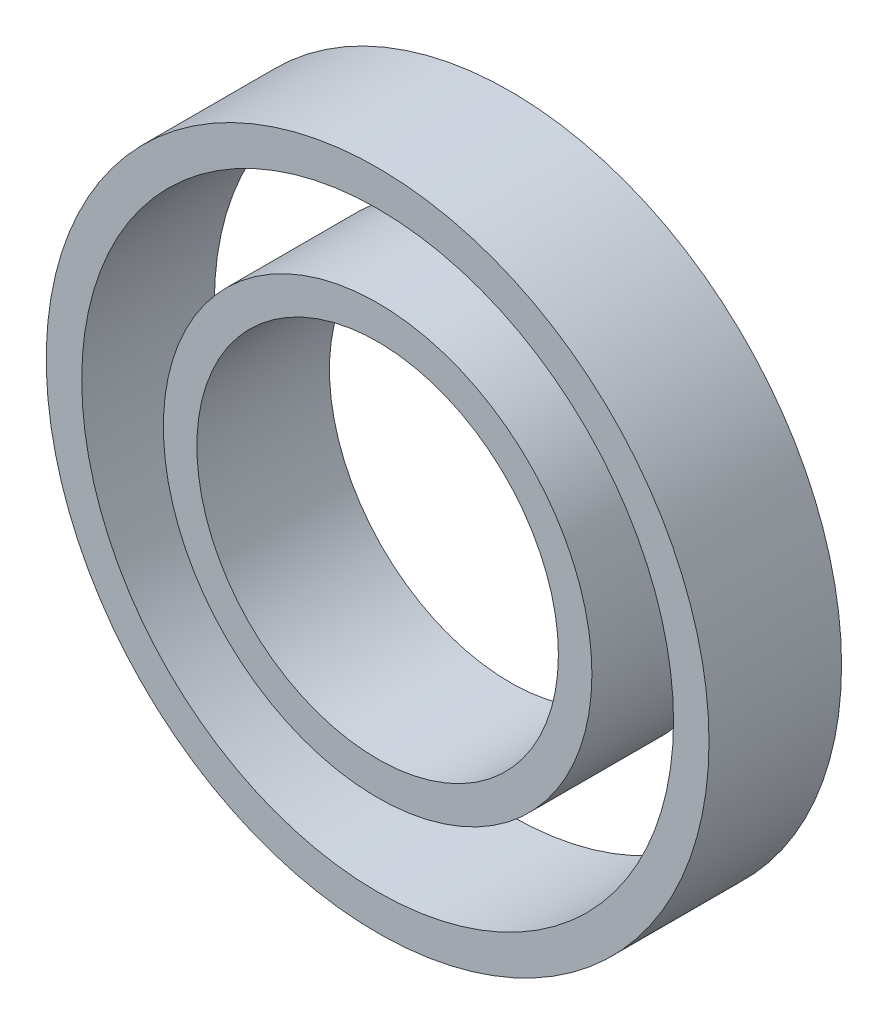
ISO-10303-21;
HEADER;
FILE_DESCRIPTION(('STEP AP214'),'2;1');
FILE_NAME('part.step','',(''),(''),'','','');
FILE_SCHEMA(('AUTOMOTIVE_DESIGN { 1 0 10303 214 1 1 1 1 }'));
ENDSEC;
DATA;
#1=APPLICATION_CONTEXT('core data for automotive mechanical design processes');
#2=APPLICATION_PROTOCOL_DEFINITION('international standard','automotive_design',2000,#1);
#3=PRODUCT_CONTEXT('',#1,'mechanical');
#4=PRODUCT('Part','Part','',(#3));
#5=PRODUCT_RELATED_PRODUCT_CATEGORY('part','',(#4));
#6=PRODUCT_DEFINITION_FORMATION('','',#4);
#7=PRODUCT_DEFINITION_CONTEXT('part definition',#1,'design');
#8=PRODUCT_DEFINITION('design','',#6,#7);
#9=PRODUCT_DEFINITION_SHAPE('','',#8);
#10=(LENGTH_UNIT() NAMED_UNIT(*) SI_UNIT(.MILLI.,.METRE.));
#11=(NAMED_UNIT(*) PLANE_ANGLE_UNIT() SI_UNIT($,.RADIAN.));
#12=(NAMED_UNIT(*) SI_UNIT($,.STERADIAN.) SOLID_ANGLE_UNIT());
#13=UNCERTAINTY_MEASURE_WITH_UNIT(LENGTH_MEASURE(1.E-05),#10,'distance_accuracy_value','');
#14=(GEOMETRIC_REPRESENTATION_CONTEXT(3) GLOBAL_UNCERTAINTY_ASSIGNED_CONTEXT((#13)) GLOBAL_UNIT_ASSIGNED_CONTEXT((#10,
#11,#12)) REPRESENTATION_CONTEXT('',''));
#15=CARTESIAN_POINT('',(0.,0.,0.));
#16=DIRECTION('',(0.,0.,1.));
#17=DIRECTION('',(1.,0.,0.));
#18=AXIS2_PLACEMENT_3D('',#15,#16,#17);
#19=CARTESIAN_POINT('',(0.,0.,10.9982));
#20=DIRECTION('',(0.,0.,-1.));
#21=DIRECTION('',(-1.,0.,0.));
#22=AXIS2_PLACEMENT_3D('',#19,#20,#21);
#23=CYLINDRICAL_SURFACE('',#22,29.9974);
#24=CARTESIAN_POINT('',(0.,0.,10.9982));
#25=DIRECTION('',(0.,0.,1.));
#26=DIRECTION('',(1.,0.,0.));
#27=AXIS2_PLACEMENT_3D('',#24,#25,#26);
#28=CIRCLE('',#27,29.9974);
#29=CARTESIAN_POINT('',(29.9974,0.,10.9982));
#30=VERTEX_POINT('',#29);
#31=EDGE_CURVE('E56',#30,#30,#28,.T.);
#32=ORIENTED_EDGE('',*,*,#31,.T.);
#33=EDGE_LOOP('',(#32));
#34=FACE_BOUND('',#33,.T.);
#35=CARTESIAN_POINT('',(0.,0.,-10.9982));
#36=DIRECTION('',(0.,0.,1.));
#37=DIRECTION('',(1.,0.,0.));
#38=AXIS2_PLACEMENT_3D('',#35,#36,#37);
#39=CIRCLE('',#38,29.9974);
#40=CARTESIAN_POINT('',(29.9974,0.,-10.9982));
#41=VERTEX_POINT('',#40);
#42=EDGE_CURVE('E64',#41,#41,#39,.T.);
#43=ORIENTED_EDGE('',*,*,#42,.F.);
#44=EDGE_LOOP('',(#43));
#45=FACE_BOUND('',#44,.T.);
#46=ADVANCED_FACE('F50',(#34,#45),#23,.F.);
#47=CARTESIAN_POINT('',(0.,0.,10.9982));
#48=DIRECTION('',(0.,0.,-1.));
#49=DIRECTION('',(-1.,0.,0.));
#50=AXIS2_PLACEMENT_3D('',#47,#48,#49);
#51=CYLINDRICAL_SURFACE('',#50,35.56);
#52=CARTESIAN_POINT('',(0.,0.,10.9982));
#53=DIRECTION('',(0.,0.,1.));
#54=DIRECTION('',(1.,0.,0.));
#55=AXIS2_PLACEMENT_3D('',#52,#53,#54);
#56=CIRCLE('',#55,35.56);
#57=CARTESIAN_POINT('',(35.56,0.,10.9982));
#58=VERTEX_POINT('',#57);
#59=EDGE_CURVE('E12',#58,#58,#56,.T.);
#60=ORIENTED_EDGE('',*,*,#59,.F.);
#61=EDGE_LOOP('',(#60));
#62=FACE_BOUND('',#61,.T.);
#63=CARTESIAN_POINT('',(0.,0.,-10.9982));
#64=DIRECTION('',(0.,0.,1.));
#65=DIRECTION('',(1.,0.,0.));
#66=AXIS2_PLACEMENT_3D('',#63,#64,#65);
#67=CIRCLE('',#66,35.56);
#68=CARTESIAN_POINT('',(35.56,0.,-10.9982));
#69=VERTEX_POINT('',#68);
#70=EDGE_CURVE('E60',#69,#69,#67,.T.);
#71=ORIENTED_EDGE('',*,*,#70,.T.);
#72=EDGE_LOOP('',(#71));
#73=FACE_BOUND('',#72,.T.);
#74=ADVANCED_FACE('F74',(#62,#73),#51,.T.);
#75=CARTESIAN_POINT('',(0.,-121.121621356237,10.9982));
#76=DIRECTION('',(0.,0.,1.));
#77=DIRECTION('',(1.,0.,0.));
#78=AXIS2_PLACEMENT_3D('',#75,#76,#77);
#79=PLANE('',#78);
#80=ORIENTED_EDGE('',*,*,#31,.F.);
#81=EDGE_LOOP('',(#80));
#82=FACE_BOUND('',#81,.T.);
#83=ORIENTED_EDGE('',*,*,#59,.T.);
#84=EDGE_LOOP('',(#83));
#85=FACE_BOUND('',#84,.T.);
#86=ADVANCED_FACE('F78',(#82,#85),#79,.T.);
#87=CARTESIAN_POINT('',(0.,-121.121621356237,-10.9982));
#88=DIRECTION('',(0.,0.,1.));
#89=DIRECTION('',(1.,0.,0.));
#90=AXIS2_PLACEMENT_3D('',#87,#88,#89);
#91=PLANE('',#90);
#92=ORIENTED_EDGE('',*,*,#42,.T.);
#93=EDGE_LOOP('',(#92));
#94=FACE_BOUND('',#93,.T.);
#95=ORIENTED_EDGE('',*,*,#70,.F.);
#96=EDGE_LOOP('',(#95));
#97=FACE_BOUND('',#96,.T.);
#98=ADVANCED_FACE('F70',(#94,#97),#91,.F.);
#99=CLOSED_SHELL('',(#46,#74,#86,#98));
#100=MANIFOLD_SOLID_BREP('B2',#99);
#101=CARTESIAN_POINT('',(0.,0.,10.9982));
#102=DIRECTION('',(0.,0.,-1.));
#103=DIRECTION('',(-1.,0.,0.));
#104=AXIS2_PLACEMENT_3D('',#101,#102,#103);
#105=CYLINDRICAL_SURFACE('',#104,49.1017520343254);
#106=CARTESIAN_POINT('',(0.,0.,10.9982));
#107=DIRECTION('',(0.,0.,1.));
#108=DIRECTION('',(1.,0.,0.));
#109=AXIS2_PLACEMENT_3D('',#106,#107,#108);
#110=CIRCLE('',#109,49.1017520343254);
#111=CARTESIAN_POINT('',(49.1017520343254,0.,10.9982));
#112=VERTEX_POINT('',#111);
#113=EDGE_CURVE('E117',#112,#112,#110,.T.);
#114=ORIENTED_EDGE('',*,*,#113,.T.);
#115=EDGE_LOOP('',(#114));
#116=FACE_BOUND('',#115,.T.);
#117=CARTESIAN_POINT('',(0.,0.,-10.9982));
#118=DIRECTION('',(0.,0.,1.));
#119=DIRECTION('',(1.,0.,0.));
#120=AXIS2_PLACEMENT_3D('',#117,#118,#119);
#121=CIRCLE('',#120,49.1017520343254);
#122=CARTESIAN_POINT('',(49.1017520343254,0.,-10.9982));
#123=VERTEX_POINT('',#122);
#124=EDGE_CURVE('E125',#123,#123,#121,.T.);
#125=ORIENTED_EDGE('',*,*,#124,.F.);
#126=EDGE_LOOP('',(#125));
#127=FACE_BOUND('',#126,.T.);
#128=ADVANCED_FACE('F111',(#116,#127),#105,.F.);
#129=CARTESIAN_POINT('',(0.,0.,10.9982));
#130=DIRECTION('',(0.,0.,-1.));
#131=DIRECTION('',(-1.,0.,0.));
#132=AXIS2_PLACEMENT_3D('',#129,#130,#131);
#133=CYLINDRICAL_SURFACE('',#132,54.991);
#134=CARTESIAN_POINT('',(0.,0.,10.9982));
#135=DIRECTION('',(0.,0.,1.));
#136=DIRECTION('',(1.,0.,0.));
#137=AXIS2_PLACEMENT_3D('',#134,#135,#136);
#138=CIRCLE('',#137,54.991);
#139=CARTESIAN_POINT('',(54.991,0.,10.9982));
#140=VERTEX_POINT('',#139);
#141=EDGE_CURVE('E49',#140,#140,#138,.T.);
#142=ORIENTED_EDGE('',*,*,#141,.F.);
#143=EDGE_LOOP('',(#142));
#144=FACE_BOUND('',#143,.T.);
#145=CARTESIAN_POINT('',(0.,0.,-10.9982));
#146=DIRECTION('',(0.,0.,1.));
#147=DIRECTION('',(1.,0.,0.));
#148=AXIS2_PLACEMENT_3D('',#145,#146,#147);
#149=CIRCLE('',#148,54.991);
#150=CARTESIAN_POINT('',(54.991,0.,-10.9982));
#151=VERTEX_POINT('',#150);
#152=EDGE_CURVE('E121',#151,#151,#149,.T.);
#153=ORIENTED_EDGE('',*,*,#152,.T.);
#154=EDGE_LOOP('',(#153));
#155=FACE_BOUND('',#154,.T.);
#156=ADVANCED_FACE('F135',(#144,#155),#133,.T.);
#157=CARTESIAN_POINT('',(0.,-121.121621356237,10.9982));
#158=DIRECTION('',(0.,0.,1.));
#159=DIRECTION('',(1.,0.,0.));
#160=AXIS2_PLACEMENT_3D('',#157,#158,#159);
#161=PLANE('',#160);
#162=ORIENTED_EDGE('',*,*,#113,.F.);
#163=EDGE_LOOP('',(#162));
#164=FACE_BOUND('',#163,.T.);
#165=ORIENTED_EDGE('',*,*,#141,.T.);
#166=EDGE_LOOP('',(#165));
#167=FACE_BOUND('',#166,.T.);
#168=ADVANCED_FACE('F139',(#164,#167),#161,.T.);
#169=CARTESIAN_POINT('',(0.,-121.121621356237,-10.9982));
#170=DIRECTION('',(0.,0.,1.));
#171=DIRECTION('',(1.,0.,0.));
#172=AXIS2_PLACEMENT_3D('',#169,#170,#171);
#173=PLANE('',#172);
#174=ORIENTED_EDGE('',*,*,#124,.T.);
#175=EDGE_LOOP('',(#174));
#176=FACE_BOUND('',#175,.T.);
#177=ORIENTED_EDGE('',*,*,#152,.F.);
#178=EDGE_LOOP('',(#177));
#179=FACE_BOUND('',#178,.T.);
#180=ADVANCED_FACE('F131',(#176,#179),#173,.F.);
#181=CLOSED_SHELL('',(#128,#156,#168,#180));
#182=MANIFOLD_SOLID_BREP('B7',#181);
#183=ADVANCED_BREP_SHAPE_REPRESENTATION('',(#18,#100,#182),#14);
#184=SHAPE_DEFINITION_REPRESENTATION(#9,#183);
ENDSEC;
END-ISO-10303-21;
